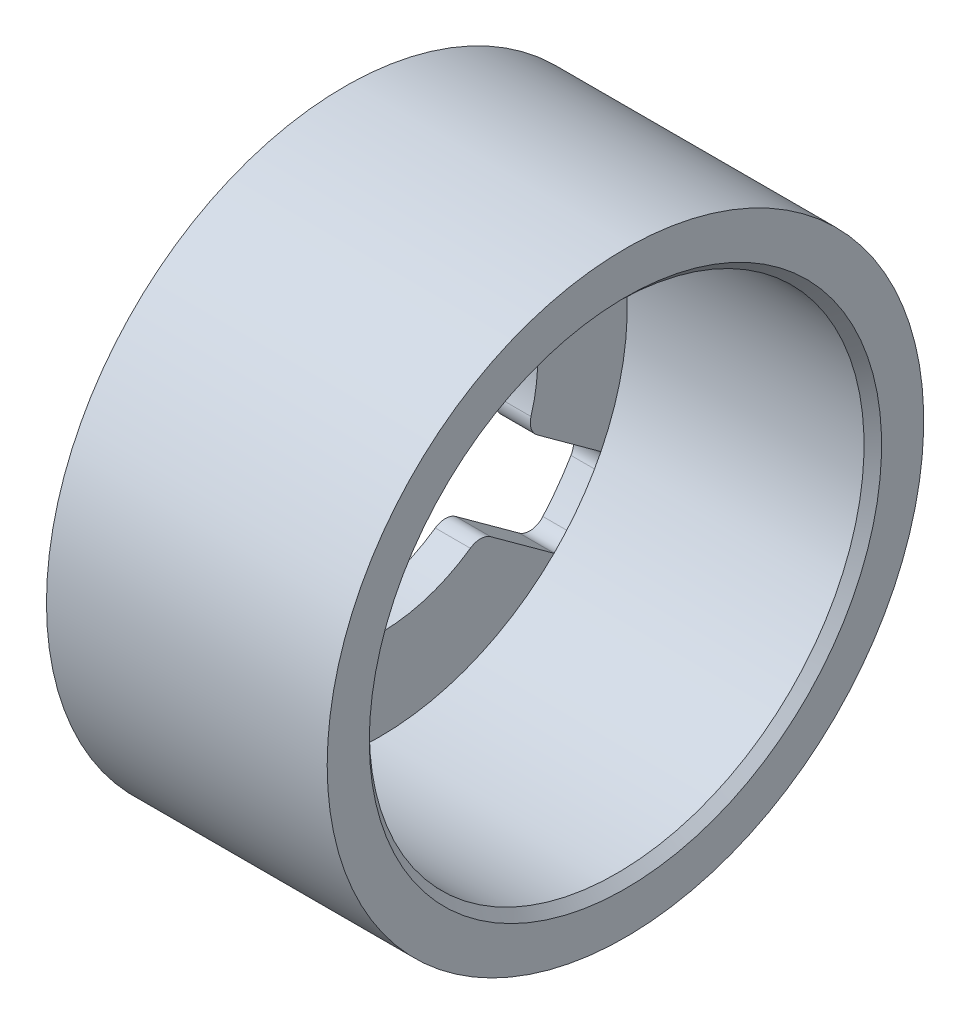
from build123d import *

# Parameters (mm, degrees)
SKETCH_2_W          = 16
SKETCH_2_H          = 1.8
CHAMFER_1_SIZE      = 0.5
EXTRUDE_START       = 2
EXTRUDE_3_DEPTH     = 2
FILLET_1_R          = 1
SKETCH_6_R          = 17
SKETCH_6_R_2        = 15.9
EXTRUDE_4_DEPTH     = 16
CUT_EXTRUDE_START   = -2
CUT_EXTRUDE_1_DEPTH = 2
FILLET_2_R          = 1


with BuildPart() as part:
    # Sketch 2 → Revolve 1 (revolve)
    with BuildSketch(Plane(origin=(0, 0, 0), x_dir=(1, 0, 0), z_dir=(0, 1, 0)), mode=Mode.PRIVATE) as revolve_1_sk:
        with Locations((0, 15)):
            Rectangle(SKETCH_2_W, SKETCH_2_H)
    revolve(revolve_1_sk.sketch.rotate(Axis((-68.553057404, 0, 0), (1, 0, 0)), 180), axis=Axis((-68.553057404, 0, 0), (1, 0, 0)))

    # Chamfer 1
    chamfer_1_edges = [part.edges().sort_by_distance(p)[0] for p in [
        (8, 0, -14.1),
    ]]
    chamfer(chamfer_1_edges, length=CHAMFER_1_SIZE)

    # Sketch 4 → Extrude 3 (add)
    with BuildSketch(Plane(origin=(-8, 0, 0), x_dir=(0, 0, -1), z_dir=(1, 0, 0)).offset(EXTRUDE_START)):
        with BuildLine():
            Line((-4.868412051, 7.569581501), (-6.478115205, 12.523738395))
            ThreePointArc((-6.478115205, 12.523738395), (-11.41666488, 8.274645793), (-13.917864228, 2.258994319))
            Line((-13.917864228, 2.258994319), (-8.711885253, 2.258994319))
            ThreePointArc((-8.711885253, 2.258994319), (-7.290864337, 5.276674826), (-4.868412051, 7.569581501))
        make_face()
        with BuildLine():
            Line((-2.152425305, 13.934743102), (-0.543689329, 8.983562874))
            ThreePointArc((-0.543689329, 8.983562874), (2.765414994, 8.564606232), (5.694677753, 6.969264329))
            Line((5.694677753, 6.969264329), (9.90893532, 10.031101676))
            ThreePointArc((9.90893532, 10.031101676), (4.341712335, 13.414899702), (-2.152425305, 13.934743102))
        make_face()
        with BuildLine():
            ThreePointArc((14.1, 0), (13.716687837, 3.26534451), (12.587592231, 6.353150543))
            Line((12.587592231, 6.353150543), (8.375866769, 3.293152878))
            ThreePointArc((8.375866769, 3.293152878), (8.999984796, 0.016542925), (8.387916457, -3.262339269))
            Line((8.387916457, -3.262339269), (12.602174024, -6.324176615))
            ThreePointArc((12.602174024, -6.324176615), (13.720434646, -3.249565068), (14.1, 0))
        make_face()
        with BuildLine():
            ThreePointArc((-2.12036344, -13.939657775), (4.372561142, -13.404876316), (9.93198514, -10.008280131))
            Line((9.93198514, -10.008280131), (5.720259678, -6.948282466))
            ThreePointArc((5.720259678, -6.948282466), (2.796881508, -8.554382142), (-0.510660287, -8.98550088))
            Line((-0.510660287, -8.98550088), (-2.12036344, -13.939657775))
        make_face()
        with BuildLine():
            Line((-8.703521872, -2.291005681), (-13.912630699, -2.291005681))
            ThreePointArc((-13.912630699, -2.291005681), (-11.397599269, -8.300887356), (-6.449287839, -12.538607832))
            Line((-6.449287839, -12.538607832), (-4.840551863, -7.587427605))
            ThreePointArc((-4.840551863, -7.587427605), (-7.271416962, -5.303441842), (-8.703521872, -2.291005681))
        make_face()
    extrude(amount=-EXTRUDE_3_DEPTH)

    # Fillet 1
    fillet_1_edges = [part.edges().sort_by_distance(p)[0] for p in [
        (-7, 7.569581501, 4.868412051),
        (-7, 2.258994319, 8.711885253),
        (-7, 6.969264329, -5.694677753),
        (-7, 8.983562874, 0.543689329),
        (-7, -3.262339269, -8.387916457),
        (-7, 3.293152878, -8.375866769),
        (-7, -8.98550088, 0.510660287),
        (-7, -6.948282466, -5.720259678),
        (-7, -2.291005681, 8.703521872),
        (-7, -7.587427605, 4.840551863),
    ]]
    fillet(fillet_1_edges, radius=FILLET_1_R)

    # Sketch 6 → Extrude 4 (add)
    with BuildSketch(Plane.ZY.offset(8)):
        Circle(SKETCH_6_R)
        Circle(SKETCH_6_R_2, mode=Mode.SUBTRACT)
    extrude(amount=-EXTRUDE_4_DEPTH)

    # Sketch 7 → Cut-Extrude 1 (cut)
    with BuildSketch(Plane.ZY.offset(8).offset(CUT_EXTRUDE_START)):
        with BuildLine():
            Line((13.917864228, 2.258994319), (14.828922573, 2.258994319))
            ThreePointArc((14.828922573, 2.258994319), (14.99999126, -0.016193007), (14.824010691, -2.291005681))
            Line((14.824010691, -2.291005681), (13.912630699, -2.291005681))
            ThreePointArc((13.912630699, -2.291005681), (14.099990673, -0.016218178), (13.917864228, 2.258994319))
        make_face()
        with BuildLine():
            Line((6.449287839, -12.538607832), (6.73082035, -13.405075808))
            ThreePointArc((6.73082035, -13.405075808), (4.61985175, -14.270843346), (2.401995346, -14.806431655))
            Line((2.401995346, -14.806431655), (2.12036344, -13.939657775))
            ThreePointArc((2.12036344, -13.939657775), (4.341712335, -13.414899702), (6.449287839, -12.538607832))
        make_face()
        with BuildLine():
            Line((-9.93198514, -10.008280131), (-10.669046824, -10.54378679))
            ThreePointArc((-10.669046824, -10.54378679), (-12.144765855, -8.803673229), (-13.339495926, -6.859872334))
            Line((-13.339495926, -6.859872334), (-12.602174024, -6.324176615))
            ThreePointArc((-12.602174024, -6.324176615), (-11.41666488, -8.274645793), (-9.93198514, -10.008280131))
        make_face()
        with BuildLine():
            Line((-12.587592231, 6.353150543), (-13.324653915, 6.888657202))
            ThreePointArc((-13.324653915, 6.888657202), (-12.125729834, 8.829874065), (-10.646257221, 10.566797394))
            Line((-10.646257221, 10.566797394), (-9.90893532, 10.031101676))
            ThreePointArc((-9.90893532, 10.031101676), (-11.397599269, 8.300887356), (-12.587592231, 6.353150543))
        make_face()
        with BuildLine():
            Line((2.152425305, 13.934743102), (2.433957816, 14.801211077))
            ThreePointArc((2.433957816, 14.801211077), (4.65065268, 14.260835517), (6.75974711, 13.390512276))
            Line((6.75974711, 13.390512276), (6.478115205, 12.523738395))
            ThreePointArc((6.478115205, 12.523738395), (4.372561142, 13.404876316), (2.152425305, 13.934743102))
        make_face()
    extrude(amount=CUT_EXTRUDE_1_DEPTH, mode=Mode.SUBTRACT)

    # Fillet 2
    fillet_2_edges = [part.edges().sort_by_distance(p)[0] for p in [
        (-7, 2.258994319, 14.828922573),
        (-7, -2.291005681, 14.824010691),
        (-7, -13.405075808, 6.73082035),
        (-7, -14.806431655, 2.401995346),
        (-7, -10.54378679, -10.669046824),
        (-7, -6.859872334, -13.339495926),
        (-7, 6.888657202, -13.324653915),
        (-7, 10.566797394, -10.646257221),
        (-7, 14.801211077, 2.433957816),
        (-7, 13.390512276, 6.75974711),
    ]]
    fillet(fillet_2_edges, radius=FILLET_2_R)


solid = part.part
